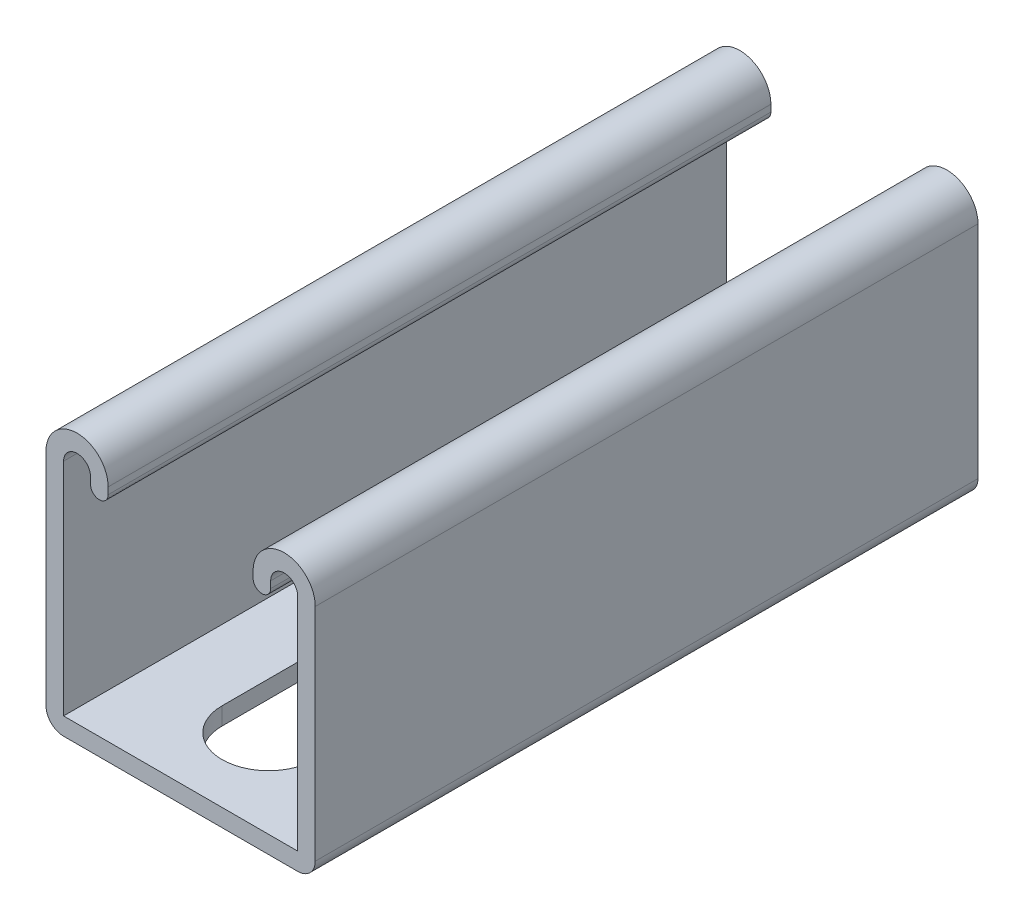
from build123d import *

# Parameters (mm, degrees)
BASE_EXTRUDE_DEPTH = 101.6
SLOT_DEPTH         = 118.403467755
LPATTERN1_COUNT    = 2
LPATTERN1_PITCH    = 50.8


with BuildPart() as part:
    # Sketch1 → Base-Extrude (new body)
    with BuildSketch(Plane.XY):
        with BuildLine():
            Line((-20.6375, 18.4785), (-20.6375, -15.3416))
            ThreePointArc((-20.6375, -15.3416), (-19.848914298, -17.245414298), (-17.9451, -18.034))
            Line((-17.9451, -18.034), (17.9451, -18.034))
            ThreePointArc((17.9451, -18.034), (19.848914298, -17.245414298), (20.6375, -15.3416))
            Line((20.6375, -15.3416), (20.6375, 18.4785))
            ThreePointArc((20.6375, 18.4785), (15.875, 23.241), (11.1125, 18.4785))
            Line((11.1125, 18.4785), (11.1125, 17.44345))
            ThreePointArc((11.1125, 17.44345), (12.4587, 16.09725), (13.8049, 17.44345))
            Line((13.8049, 17.44345), (13.8049, 18.4785))
            ThreePointArc((13.8049, 18.4785), (15.875, 20.5486), (17.9451, 18.4785))
            Line((17.9451, 18.4785), (17.9451, -15.3416))
            Line((17.9451, -15.3416), (-17.9451, -15.3416))
            Line((-17.9451, -15.3416), (-17.9451, 18.4785))
            ThreePointArc((-17.9451, 18.4785), (-15.875, 20.5486), (-13.8049, 18.4785))
            Line((-13.8049, 18.4785), (-13.8049, 17.44345))
            ThreePointArc((-13.8049, 17.44345), (-12.4587, 16.09725), (-11.1125, 17.44345))
            Line((-11.1125, 17.44345), (-11.1125, 18.4785))
            ThreePointArc((-11.1125, 18.4785), (-15.875, 23.241), (-20.6375, 18.4785))
        make_face()
    extrude(amount=BASE_EXTRUDE_DEPTH)

    # Sketch2 → Slot (cut, through all)
    with BuildSketch(Plane(origin=(-0.093451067, -18.034, -6.33598234), x_dir=(1, 0, 0), z_dir=(0, -1, 0))):
        with BuildLine():
            Line((7.237201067, 43.64223234), (7.237201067, 29.35473234))
            ThreePointArc((7.237201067, 29.35473234), (0.093451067, 22.21098234), (-7.050298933, 29.35473234))
            Line((-7.050298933, 29.35473234), (-7.050298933, 43.64223234))
            ThreePointArc((-7.050298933, 43.64223234), (0.093451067, 50.78598234), (7.237201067, 43.64223234))
        make_face()
    slot = extrude(amount=-SLOT_DEPTH, mode=Mode.SUBTRACT)

    # LPattern1: Slot ×2
    with Locations(*[(0, 0, i * LPATTERN1_PITCH) for i in range(1, LPATTERN1_COUNT)]):
        add(slot, mode=Mode.SUBTRACT)


solid = part.part
